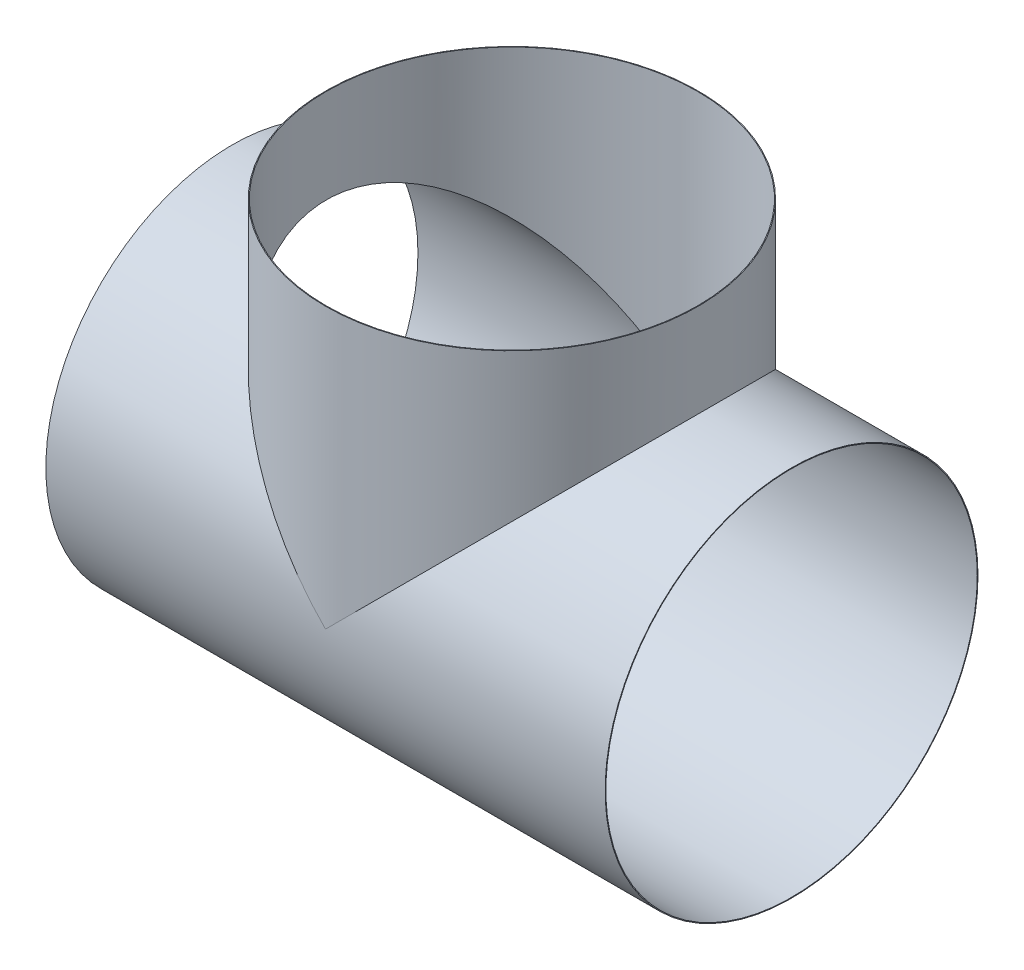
ISO-10303-21;
HEADER;
FILE_DESCRIPTION(('STEP AP214'),'2;1');
FILE_NAME('part.step','',(''),(''),'','','');
FILE_SCHEMA(('AUTOMOTIVE_DESIGN { 1 0 10303 214 1 1 1 1 }'));
ENDSEC;
DATA;
#1=APPLICATION_CONTEXT('core data for automotive mechanical design processes');
#2=APPLICATION_PROTOCOL_DEFINITION('international standard','automotive_design',2000,#1);
#3=PRODUCT_CONTEXT('',#1,'mechanical');
#4=PRODUCT('Part','Part','',(#3));
#5=PRODUCT_RELATED_PRODUCT_CATEGORY('part','',(#4));
#6=PRODUCT_DEFINITION_FORMATION('','',#4);
#7=PRODUCT_DEFINITION_CONTEXT('part definition',#1,'design');
#8=PRODUCT_DEFINITION('design','',#6,#7);
#9=PRODUCT_DEFINITION_SHAPE('','',#8);
#10=(LENGTH_UNIT() NAMED_UNIT(*) SI_UNIT(.MILLI.,.METRE.));
#11=(NAMED_UNIT(*) PLANE_ANGLE_UNIT() SI_UNIT($,.RADIAN.));
#12=(NAMED_UNIT(*) SI_UNIT($,.STERADIAN.) SOLID_ANGLE_UNIT());
#13=UNCERTAINTY_MEASURE_WITH_UNIT(LENGTH_MEASURE(1.E-05),#10,'distance_accuracy_value','');
#14=(GEOMETRIC_REPRESENTATION_CONTEXT(3) GLOBAL_UNCERTAINTY_ASSIGNED_CONTEXT((#13)) GLOBAL_UNIT_ASSIGNED_CONTEXT((#10,
#11,#12)) REPRESENTATION_CONTEXT('',''));
#15=CARTESIAN_POINT('',(0.,0.,0.));
#16=DIRECTION('',(0.,0.,1.));
#17=DIRECTION('',(1.,0.,0.));
#18=AXIS2_PLACEMENT_3D('',#15,#16,#17);
#19=CARTESIAN_POINT('',(750.,0.,0.));
#20=DIRECTION('',(1.,0.,0.));
#21=DIRECTION('',(0.,0.,-1.));
#22=AXIS2_PLACEMENT_3D('',#19,#20,#21);
#23=PLANE('',#22);
#24=CARTESIAN_POINT('',(750.,0.,0.));
#25=DIRECTION('',(1.,0.,0.));
#26=DIRECTION('',(0.,0.,-1.));
#27=AXIS2_PLACEMENT_3D('',#24,#25,#26);
#28=CIRCLE('',#27,500.);
#29=CARTESIAN_POINT('',(750.,0.,-500.));
#30=VERTEX_POINT('',#29);
#31=EDGE_CURVE('E12',#30,#30,#28,.T.);
#32=ORIENTED_EDGE('',*,*,#31,.T.);
#33=EDGE_LOOP('',(#32));
#34=FACE_BOUND('',#33,.T.);
#35=CARTESIAN_POINT('',(750.,0.,0.));
#36=DIRECTION('',(1.,0.,0.));
#37=DIRECTION('',(0.,0.,-1.));
#38=AXIS2_PLACEMENT_3D('',#35,#36,#37);
#39=CIRCLE('',#38,498.);
#40=CARTESIAN_POINT('',(750.,0.,-498.));
#41=VERTEX_POINT('',#40);
#42=EDGE_CURVE('E88',#41,#41,#39,.T.);
#43=ORIENTED_EDGE('',*,*,#42,.F.);
#44=EDGE_LOOP('',(#43));
#45=FACE_BOUND('',#44,.T.);
#46=ADVANCED_FACE('F44',(#34,#45),#23,.T.);
#47=CARTESIAN_POINT('',(-750.,0.,0.));
#48=DIRECTION('',(1.,0.,0.));
#49=DIRECTION('',(0.,0.,-1.));
#50=AXIS2_PLACEMENT_3D('',#47,#48,#49);
#51=PLANE('',#50);
#52=CARTESIAN_POINT('',(-750.,0.,0.));
#53=DIRECTION('',(1.,0.,0.));
#54=DIRECTION('',(0.,0.,-1.));
#55=AXIS2_PLACEMENT_3D('',#52,#53,#54);
#56=CIRCLE('',#55,500.);
#57=CARTESIAN_POINT('',(-750.,0.,-500.));
#58=VERTEX_POINT('',#57);
#59=EDGE_CURVE('E48',#58,#58,#56,.T.);
#60=ORIENTED_EDGE('',*,*,#59,.F.);
#61=EDGE_LOOP('',(#60));
#62=FACE_BOUND('',#61,.T.);
#63=CARTESIAN_POINT('',(-750.,0.,0.));
#64=DIRECTION('',(1.,0.,0.));
#65=DIRECTION('',(0.,0.,-1.));
#66=AXIS2_PLACEMENT_3D('',#63,#64,#65);
#67=CIRCLE('',#66,498.);
#68=CARTESIAN_POINT('',(-750.,0.,-498.));
#69=VERTEX_POINT('',#68);
#70=EDGE_CURVE('E84',#69,#69,#67,.T.);
#71=ORIENTED_EDGE('',*,*,#70,.T.);
#72=EDGE_LOOP('',(#71));
#73=FACE_BOUND('',#72,.T.);
#74=ADVANCED_FACE('F94',(#62,#73),#51,.F.);
#75=CARTESIAN_POINT('',(750.,0.,0.));
#76=DIRECTION('',(-1.,0.,0.));
#77=DIRECTION('',(0.,0.,1.));
#78=AXIS2_PLACEMENT_3D('',#75,#76,#77);
#79=CYLINDRICAL_SURFACE('',#78,500.);
#80=CARTESIAN_POINT('',(0.,0.,0.));
#81=DIRECTION('',(0.707106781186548,0.707106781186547,0.));
#82=DIRECTION('',(-0.707106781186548,0.707106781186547,0.));
#83=AXIS2_PLACEMENT_3D('',#80,#81,#82);
#84=ELLIPSE('',#83,707.106781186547,500.);
#85=CARTESIAN_POINT('',(-1.11022302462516E-13,-1.11022302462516E-13,-500.));
#86=VERTEX_POINT('',#85);
#87=CARTESIAN_POINT('',(0.,0.,500.));
#88=VERTEX_POINT('',#87);
#89=EDGE_CURVE('E82',#86,#88,#84,.T.);
#90=ORIENTED_EDGE('',*,*,#89,.F.);
#91=CARTESIAN_POINT('',(0.,0.,0.));
#92=DIRECTION('',(-0.707106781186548,0.707106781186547,0.));
#93=DIRECTION('',(0.707106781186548,0.707106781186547,0.));
#94=AXIS2_PLACEMENT_3D('',#91,#92,#93);
#95=ELLIPSE('',#94,707.106781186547,500.);
#96=EDGE_CURVE('E65',#88,#86,#95,.T.);
#97=ORIENTED_EDGE('',*,*,#96,.F.);
#98=EDGE_LOOP('',(#90,#97));
#99=FACE_BOUND('',#98,.T.);
#100=ORIENTED_EDGE('',*,*,#31,.F.);
#101=EDGE_LOOP('',(#100));
#102=FACE_BOUND('',#101,.T.);
#103=ORIENTED_EDGE('',*,*,#59,.T.);
#104=EDGE_LOOP('',(#103));
#105=FACE_BOUND('',#104,.T.);
#106=ADVANCED_FACE('F46',(#99,#102,#105),#79,.T.);
#107=CARTESIAN_POINT('',(750.,0.,0.));
#108=DIRECTION('',(-1.,0.,0.));
#109=DIRECTION('',(0.,0.,1.));
#110=AXIS2_PLACEMENT_3D('',#107,#108,#109);
#111=CYLINDRICAL_SURFACE('',#110,498.);
#112=CARTESIAN_POINT('',(0.,0.,0.));
#113=DIRECTION('',(-0.707106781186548,0.707106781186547,0.));
#114=DIRECTION('',(0.707106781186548,0.707106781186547,0.));
#115=AXIS2_PLACEMENT_3D('',#112,#113,#114);
#116=ELLIPSE('',#115,704.278354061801,498.);
#117=CARTESIAN_POINT('',(-1.11022302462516E-13,-1.11022302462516E-13,498.));
#118=VERTEX_POINT('',#117);
#119=CARTESIAN_POINT('',(0.,0.,-498.));
#120=VERTEX_POINT('',#119);
#121=EDGE_CURVE('E58',#118,#120,#116,.T.);
#122=ORIENTED_EDGE('',*,*,#121,.T.);
#123=CARTESIAN_POINT('',(0.,0.,0.));
#124=DIRECTION('',(0.707106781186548,0.707106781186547,0.));
#125=DIRECTION('',(-0.707106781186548,0.707106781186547,0.));
#126=AXIS2_PLACEMENT_3D('',#123,#124,#125);
#127=ELLIPSE('',#126,704.278354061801,498.);
#128=EDGE_CURVE('E70',#120,#118,#127,.T.);
#129=ORIENTED_EDGE('',*,*,#128,.T.);
#130=EDGE_LOOP('',(#122,#129));
#131=FACE_BOUND('',#130,.T.);
#132=ORIENTED_EDGE('',*,*,#42,.T.);
#133=EDGE_LOOP('',(#132));
#134=FACE_BOUND('',#133,.T.);
#135=ORIENTED_EDGE('',*,*,#70,.F.);
#136=EDGE_LOOP('',(#135));
#137=FACE_BOUND('',#136,.T.);
#138=ADVANCED_FACE('F74',(#131,#134,#137),#111,.F.);
#139=CARTESIAN_POINT('',(0.,-500.001,0.));
#140=DIRECTION('',(0.,1.,0.));
#141=DIRECTION('',(0.,0.,1.));
#142=AXIS2_PLACEMENT_3D('',#139,#140,#141);
#143=CYLINDRICAL_SURFACE('',#142,500.);
#144=CARTESIAN_POINT('',(0.,750.,0.));
#145=DIRECTION('',(0.,1.,0.));
#146=DIRECTION('',(0.,0.,1.));
#147=AXIS2_PLACEMENT_3D('',#144,#145,#146);
#148=CIRCLE('',#147,500.);
#149=CARTESIAN_POINT('',(0.,750.,500.));
#150=VERTEX_POINT('',#149);
#151=EDGE_CURVE('E79',#150,#150,#148,.T.);
#152=ORIENTED_EDGE('',*,*,#151,.F.);
#153=EDGE_LOOP('',(#152));
#154=FACE_BOUND('',#153,.T.);
#155=ORIENTED_EDGE('',*,*,#89,.T.);
#156=ORIENTED_EDGE('',*,*,#96,.T.);
#157=EDGE_LOOP('',(#155,#156));
#158=FACE_BOUND('',#157,.T.);
#159=ADVANCED_FACE('F97',(#154,#158),#143,.T.);
#160=CARTESIAN_POINT('',(0.,750.,0.));
#161=DIRECTION('',(0.,1.,0.));
#162=DIRECTION('',(0.,0.,1.));
#163=AXIS2_PLACEMENT_3D('',#160,#161,#162);
#164=PLANE('',#163);
#165=CARTESIAN_POINT('',(0.,750.,0.));
#166=DIRECTION('',(0.,1.,0.));
#167=DIRECTION('',(1.,0.,0.));
#168=AXIS2_PLACEMENT_3D('',#165,#166,#167);
#169=CIRCLE('',#168,498.);
#170=CARTESIAN_POINT('',(498.,750.,0.));
#171=VERTEX_POINT('',#170);
#172=EDGE_CURVE('E76',#171,#171,#169,.T.);
#173=ORIENTED_EDGE('',*,*,#172,.F.);
#174=EDGE_LOOP('',(#173));
#175=FACE_BOUND('',#174,.T.);
#176=ORIENTED_EDGE('',*,*,#151,.T.);
#177=EDGE_LOOP('',(#176));
#178=FACE_BOUND('',#177,.T.);
#179=ADVANCED_FACE('F103',(#175,#178),#164,.T.);
#180=CARTESIAN_POINT('',(0.,-500.001,0.));
#181=DIRECTION('',(0.,1.,0.));
#182=DIRECTION('',(0.,0.,1.));
#183=AXIS2_PLACEMENT_3D('',#180,#181,#182);
#184=CYLINDRICAL_SURFACE('',#183,498.);
#185=ORIENTED_EDGE('',*,*,#172,.T.);
#186=EDGE_LOOP('',(#185));
#187=FACE_BOUND('',#186,.T.);
#188=ORIENTED_EDGE('',*,*,#128,.F.);
#189=ORIENTED_EDGE('',*,*,#121,.F.);
#190=EDGE_LOOP('',(#188,#189));
#191=FACE_BOUND('',#190,.T.);
#192=ADVANCED_FACE('F71',(#187,#191),#184,.F.);
#193=CLOSED_SHELL('',(#46,#74,#106,#138,#159,#179,#192));
#194=MANIFOLD_SOLID_BREP('B2',#193);
#195=ADVANCED_BREP_SHAPE_REPRESENTATION('',(#18,#194),#14);
#196=SHAPE_DEFINITION_REPRESENTATION(#9,#195);
ENDSEC;
END-ISO-10303-21;
